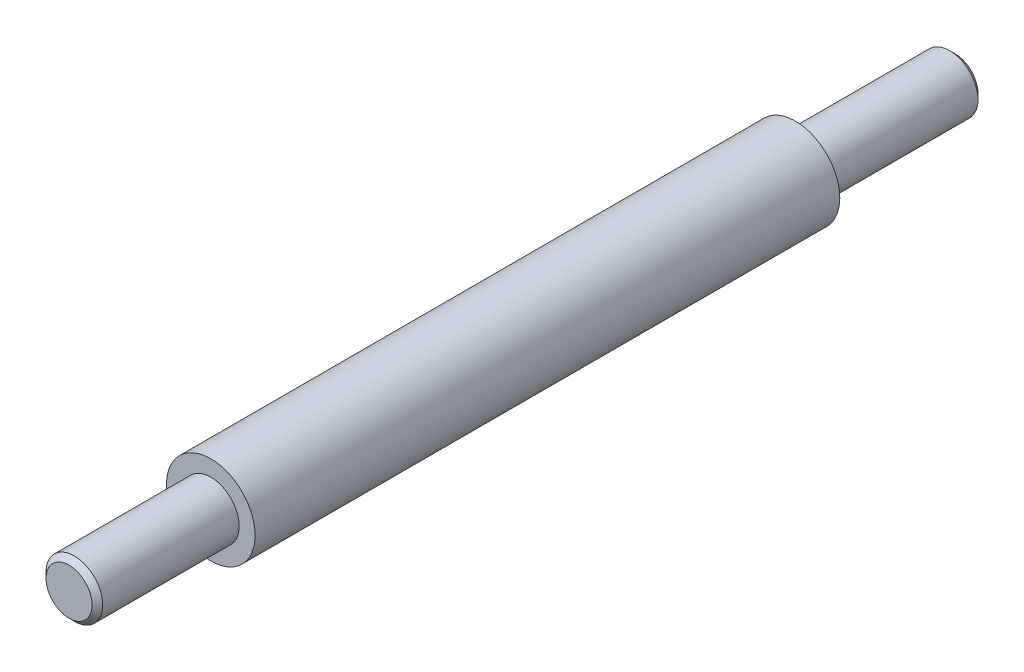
from build123d import *

# Parameters (mm, degrees)
ESQUISSE1_R        = 12.5
BOSS_EXTRU_1_DEPTH = 165
ESQUISSE2_R        = 8
BOSS_EXTRU_2_DEPTH = 45
CHANFREIN1_SIZE    = 1.5
BOSS_EXTRU_3_START = 40
ESQUISSE3_R        = 8
BOSS_EXTRU_3_DEPTH = 40
CHANFREIN2_SIZE    = 1.5


with BuildPart() as part:
    # Esquisse1 → Boss.-Extru.1 (new body)
    with BuildSketch(Plane.XY):
        Circle(ESQUISSE1_R)
    extrude(amount=BOSS_EXTRU_1_DEPTH)

    # Esquisse2 → Boss.-Extru.2 (add)
    with BuildSketch(Plane(origin=(0, 0, 0), x_dir=(-1, 0, 0), z_dir=(0, 0, -1))):
        with Locations(Location((0, 0, 0), (0, 0, 180))):
            Circle(ESQUISSE2_R)
    extrude(amount=BOSS_EXTRU_2_DEPTH)

    # Chanfrein1
    chanfrein1_edges = [part.edges().sort_by_distance(p)[0] for p in [
        (-8, 0, -45),
    ]]
    chamfer(chanfrein1_edges, length=CHANFREIN1_SIZE)

    # Esquisse3 → Boss.-Extru.3 (add)
    with BuildSketch(Plane.XY.offset(165).offset(BOSS_EXTRU_3_START)):
        Circle(ESQUISSE3_R)
    extrude(amount=-BOSS_EXTRU_3_DEPTH)

    # Chanfrein2
    chanfrein2_edges = [part.edges().sort_by_distance(p)[0] for p in [
        (-8, 0, 205),
    ]]
    chamfer(chanfrein2_edges, length=CHANFREIN2_SIZE)


solid = part.part
